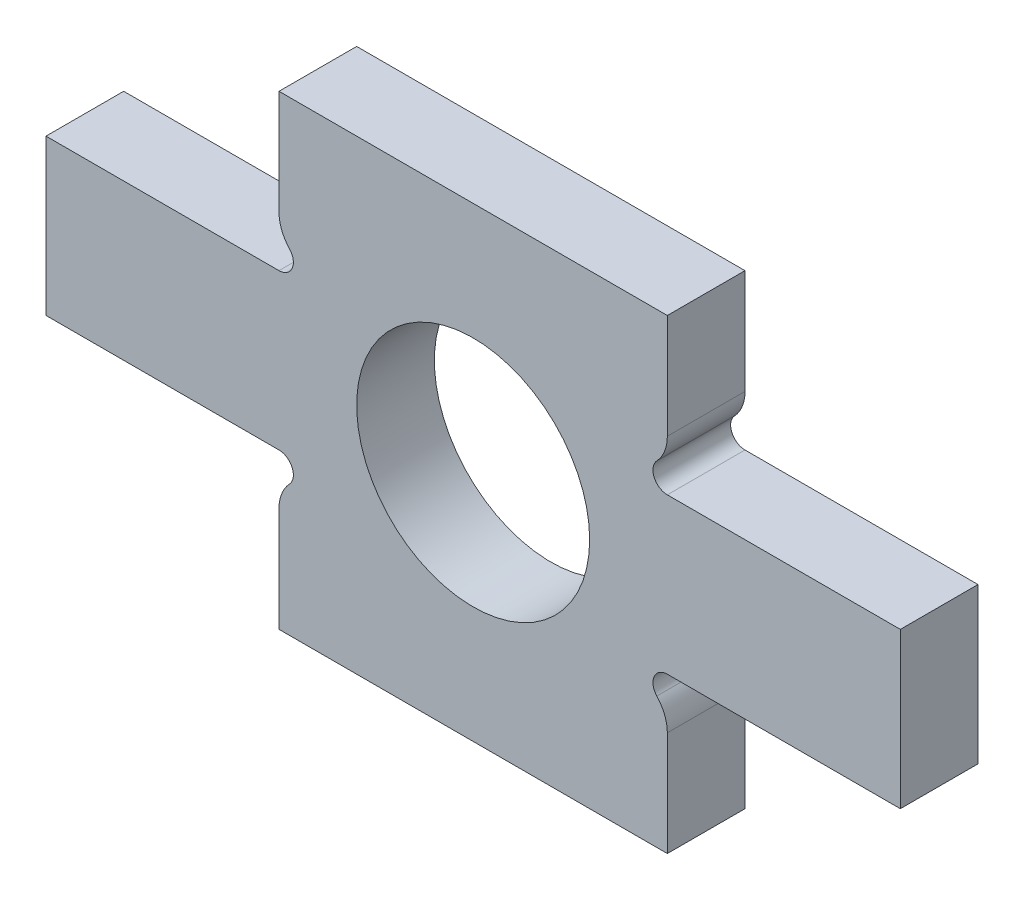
ISO-10303-21;
HEADER;
FILE_DESCRIPTION(('STEP AP214'),'2;1');
FILE_NAME('part.step','',(''),(''),'','','');
FILE_SCHEMA(('AUTOMOTIVE_DESIGN { 1 0 10303 214 1 1 1 1 }'));
ENDSEC;
DATA;
#1=APPLICATION_CONTEXT('core data for automotive mechanical design processes');
#2=APPLICATION_PROTOCOL_DEFINITION('international standard','automotive_design',2000,#1);
#3=PRODUCT_CONTEXT('',#1,'mechanical');
#4=PRODUCT('Part','Part','',(#3));
#5=PRODUCT_RELATED_PRODUCT_CATEGORY('part','',(#4));
#6=PRODUCT_DEFINITION_FORMATION('','',#4);
#7=PRODUCT_DEFINITION_CONTEXT('part definition',#1,'design');
#8=PRODUCT_DEFINITION('design','',#6,#7);
#9=PRODUCT_DEFINITION_SHAPE('','',#8);
#10=(LENGTH_UNIT() NAMED_UNIT(*) SI_UNIT(.MILLI.,.METRE.));
#11=(NAMED_UNIT(*) PLANE_ANGLE_UNIT() SI_UNIT($,.RADIAN.));
#12=(NAMED_UNIT(*) SI_UNIT($,.STERADIAN.) SOLID_ANGLE_UNIT());
#13=UNCERTAINTY_MEASURE_WITH_UNIT(LENGTH_MEASURE(1.E-05),#10,'distance_accuracy_value','');
#14=(GEOMETRIC_REPRESENTATION_CONTEXT(3) GLOBAL_UNCERTAINTY_ASSIGNED_CONTEXT((#13)) GLOBAL_UNIT_ASSIGNED_CONTEXT((#10,
#11,#12)) REPRESENTATION_CONTEXT('',''));
#15=CARTESIAN_POINT('',(0.,0.,0.));
#16=DIRECTION('',(0.,0.,1.));
#17=DIRECTION('',(1.,0.,0.));
#18=AXIS2_PLACEMENT_3D('',#15,#16,#17);
#19=CARTESIAN_POINT('',(19.9999999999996,-16.5321469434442,10.));
#20=DIRECTION('',(0.,0.,-1.));
#21=DIRECTION('',(-1.,0.,0.));
#22=AXIS2_PLACEMENT_3D('',#19,#20,#21);
#23=CYLINDRICAL_SURFACE('',#22,5.00000000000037);
#24=CARTESIAN_POINT('',(19.9999999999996,-16.5321469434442,0.));
#25=DIRECTION('',(0.,0.,1.));
#26=DIRECTION('',(1.,0.,0.));
#27=AXIS2_PLACEMENT_3D('',#24,#25,#26);
#28=CIRCLE('',#27,5.00000000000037);
#29=CARTESIAN_POINT('',(25.,-16.5321469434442,0.));
#30=VERTEX_POINT('',#29);
#31=CARTESIAN_POINT('',(23.6496350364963,-13.1145214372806,0.));
#32=VERTEX_POINT('',#31);
#33=EDGE_CURVE('E218',#30,#32,#28,.T.);
#34=ORIENTED_EDGE('',*,*,#33,.T.);
#35=DIRECTION('',(0.,0.,-1.));
#36=VECTOR('',#35,1.);
#37=CARTESIAN_POINT('',(23.6496350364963,-13.1145214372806,10.));
#38=LINE('',#37,#36);
#39=CARTESIAN_POINT('',(23.6496350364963,-13.1145214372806,10.));
#40=VERTEX_POINT('',#39);
#41=EDGE_CURVE('E11',#40,#32,#38,.T.);
#42=ORIENTED_EDGE('',*,*,#41,.F.);
#43=CARTESIAN_POINT('',(19.9999999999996,-16.5321469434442,10.));
#44=DIRECTION('',(0.,0.,1.));
#45=DIRECTION('',(1.,0.,0.));
#46=AXIS2_PLACEMENT_3D('',#43,#44,#45);
#47=CIRCLE('',#46,5.00000000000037);
#48=CARTESIAN_POINT('',(25.,-16.5321469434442,10.));
#49=VERTEX_POINT('',#48);
#50=EDGE_CURVE('E277',#49,#40,#47,.T.);
#51=ORIENTED_EDGE('',*,*,#50,.F.);
#52=DIRECTION('',(0.,0.,-1.));
#53=VECTOR('',#52,1.);
#54=CARTESIAN_POINT('',(25.,-16.5321469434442,10.));
#55=LINE('',#54,#53);
#56=EDGE_CURVE('E214',#49,#30,#55,.T.);
#57=ORIENTED_EDGE('',*,*,#56,.T.);
#58=EDGE_LOOP('',(#34,#42,#51,#57));
#59=FACE_BOUND('',#58,.T.);
#60=ADVANCED_FACE('F45',(#59),#23,.T.);
#61=CARTESIAN_POINT('',(25.,-11.8500000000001,10.));
#62=DIRECTION('',(0.,0.,-1.));
#63=DIRECTION('',(-1.,0.,0.));
#64=AXIS2_PLACEMENT_3D('',#61,#62,#63);
#65=CYLINDRICAL_SURFACE('',#64,1.85000000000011);
#66=CARTESIAN_POINT('',(25.,-11.8500000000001,0.));
#67=DIRECTION('',(0.,0.,-1.));
#68=DIRECTION('',(1.,0.,0.));
#69=AXIS2_PLACEMENT_3D('',#66,#67,#68);
#70=CIRCLE('',#69,1.85000000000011);
#71=CARTESIAN_POINT('',(25.,-10.,0.));
#72=VERTEX_POINT('',#71);
#73=EDGE_CURVE('E222',#32,#72,#70,.T.);
#74=ORIENTED_EDGE('',*,*,#73,.T.);
#75=DIRECTION('',(0.,0.,-1.));
#76=VECTOR('',#75,1.);
#77=CARTESIAN_POINT('',(25.,-10.,10.));
#78=LINE('',#77,#76);
#79=CARTESIAN_POINT('',(25.,-10.,10.));
#80=VERTEX_POINT('',#79);
#81=EDGE_CURVE('E54',#80,#72,#78,.T.);
#82=ORIENTED_EDGE('',*,*,#81,.F.);
#83=CARTESIAN_POINT('',(25.,-11.8500000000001,10.));
#84=DIRECTION('',(0.,0.,-1.));
#85=DIRECTION('',(1.,0.,0.));
#86=AXIS2_PLACEMENT_3D('',#83,#84,#85);
#87=CIRCLE('',#86,1.85000000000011);
#88=EDGE_CURVE('E141',#40,#80,#87,.T.);
#89=ORIENTED_EDGE('',*,*,#88,.F.);
#90=ORIENTED_EDGE('',*,*,#41,.T.);
#91=EDGE_LOOP('',(#74,#82,#89,#90));
#92=FACE_BOUND('',#91,.T.);
#93=ADVANCED_FACE('F428',(#92),#65,.F.);
#94=CARTESIAN_POINT('',(25.,-10.,10.));
#95=DIRECTION('',(0.,1.,0.));
#96=DIRECTION('',(0.,0.,1.));
#97=AXIS2_PLACEMENT_3D('',#94,#95,#96);
#98=PLANE('',#97);
#99=DIRECTION('',(1.,0.,0.));
#100=VECTOR('',#99,1.);
#101=CARTESIAN_POINT('',(25.,-10.,0.));
#102=LINE('',#101,#100);
#103=CARTESIAN_POINT('',(55.,-10.,0.));
#104=VERTEX_POINT('',#103);
#105=EDGE_CURVE('E226',#72,#104,#102,.T.);
#106=ORIENTED_EDGE('',*,*,#105,.T.);
#107=DIRECTION('',(0.,0.,-1.));
#108=VECTOR('',#107,1.);
#109=CARTESIAN_POINT('',(55.,-10.,10.));
#110=LINE('',#109,#108);
#111=CARTESIAN_POINT('',(55.,-10.,10.));
#112=VERTEX_POINT('',#111);
#113=EDGE_CURVE('E336',#112,#104,#110,.T.);
#114=ORIENTED_EDGE('',*,*,#113,.F.);
#115=DIRECTION('',(1.,0.,0.));
#116=VECTOR('',#115,1.);
#117=CARTESIAN_POINT('',(25.,-10.,10.));
#118=LINE('',#117,#116);
#119=EDGE_CURVE('E346',#80,#112,#118,.T.);
#120=ORIENTED_EDGE('',*,*,#119,.F.);
#121=ORIENTED_EDGE('',*,*,#81,.T.);
#122=EDGE_LOOP('',(#106,#114,#120,#121));
#123=FACE_BOUND('',#122,.T.);
#124=ADVANCED_FACE('F344',(#123),#98,.F.);
#125=CARTESIAN_POINT('',(55.,-10.,10.));
#126=DIRECTION('',(-1.,0.,0.));
#127=DIRECTION('',(0.,0.,1.));
#128=AXIS2_PLACEMENT_3D('',#125,#126,#127);
#129=PLANE('',#128);
#130=DIRECTION('',(0.,1.,0.));
#131=VECTOR('',#130,1.);
#132=CARTESIAN_POINT('',(55.,-10.,0.));
#133=LINE('',#132,#131);
#134=CARTESIAN_POINT('',(55.,10.,0.));
#135=VERTEX_POINT('',#134);
#136=EDGE_CURVE('E229',#104,#135,#133,.T.);
#137=ORIENTED_EDGE('',*,*,#136,.T.);
#138=DIRECTION('',(0.,0.,-1.));
#139=VECTOR('',#138,1.);
#140=CARTESIAN_POINT('',(55.,10.,10.));
#141=LINE('',#140,#139);
#142=CARTESIAN_POINT('',(55.,10.,10.));
#143=VERTEX_POINT('',#142);
#144=EDGE_CURVE('E332',#143,#135,#141,.T.);
#145=ORIENTED_EDGE('',*,*,#144,.F.);
#146=DIRECTION('',(0.,1.,0.));
#147=VECTOR('',#146,1.);
#148=CARTESIAN_POINT('',(55.,-10.,10.));
#149=LINE('',#148,#147);
#150=EDGE_CURVE('E365',#112,#143,#149,.T.);
#151=ORIENTED_EDGE('',*,*,#150,.F.);
#152=ORIENTED_EDGE('',*,*,#113,.T.);
#153=EDGE_LOOP('',(#137,#145,#151,#152));
#154=FACE_BOUND('',#153,.T.);
#155=ADVANCED_FACE('F355',(#154),#129,.F.);
#156=CARTESIAN_POINT('',(55.,10.,10.));
#157=DIRECTION('',(0.,-1.,0.));
#158=DIRECTION('',(0.,0.,-1.));
#159=AXIS2_PLACEMENT_3D('',#156,#157,#158);
#160=PLANE('',#159);
#161=DIRECTION('',(-1.,0.,0.));
#162=VECTOR('',#161,1.);
#163=CARTESIAN_POINT('',(55.,10.,0.));
#164=LINE('',#163,#162);
#165=CARTESIAN_POINT('',(25.,10.,0.));
#166=VERTEX_POINT('',#165);
#167=EDGE_CURVE('E232',#135,#166,#164,.T.);
#168=ORIENTED_EDGE('',*,*,#167,.T.);
#169=DIRECTION('',(0.,0.,-1.));
#170=VECTOR('',#169,1.);
#171=CARTESIAN_POINT('',(25.,10.,10.));
#172=LINE('',#171,#170);
#173=CARTESIAN_POINT('',(25.,10.,10.));
#174=VERTEX_POINT('',#173);
#175=EDGE_CURVE('E328',#174,#166,#172,.T.);
#176=ORIENTED_EDGE('',*,*,#175,.F.);
#177=DIRECTION('',(-1.,0.,0.));
#178=VECTOR('',#177,1.);
#179=CARTESIAN_POINT('',(55.,10.,10.));
#180=LINE('',#179,#178);
#181=EDGE_CURVE('E361',#143,#174,#180,.T.);
#182=ORIENTED_EDGE('',*,*,#181,.F.);
#183=ORIENTED_EDGE('',*,*,#144,.T.);
#184=EDGE_LOOP('',(#168,#176,#182,#183));
#185=FACE_BOUND('',#184,.T.);
#186=ADVANCED_FACE('F359',(#185),#160,.F.);
#187=CARTESIAN_POINT('',(25.,11.8500000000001,10.));
#188=DIRECTION('',(0.,0.,-1.));
#189=DIRECTION('',(-1.,0.,0.));
#190=AXIS2_PLACEMENT_3D('',#187,#188,#189);
#191=CYLINDRICAL_SURFACE('',#190,1.85000000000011);
#192=CARTESIAN_POINT('',(25.,11.8500000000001,0.));
#193=DIRECTION('',(0.,0.,-1.));
#194=DIRECTION('',(1.,0.,0.));
#195=AXIS2_PLACEMENT_3D('',#192,#193,#194);
#196=CIRCLE('',#195,1.85000000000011);
#197=CARTESIAN_POINT('',(23.6496350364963,13.1145214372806,0.));
#198=VERTEX_POINT('',#197);
#199=EDGE_CURVE('E235',#166,#198,#196,.T.);
#200=ORIENTED_EDGE('',*,*,#199,.T.);
#201=DIRECTION('',(0.,0.,-1.));
#202=VECTOR('',#201,1.);
#203=CARTESIAN_POINT('',(23.6496350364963,13.1145214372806,10.));
#204=LINE('',#203,#202);
#205=CARTESIAN_POINT('',(23.6496350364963,13.1145214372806,10.));
#206=VERTEX_POINT('',#205);
#207=EDGE_CURVE('E324',#206,#198,#204,.T.);
#208=ORIENTED_EDGE('',*,*,#207,.F.);
#209=CARTESIAN_POINT('',(25.,11.8500000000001,10.));
#210=DIRECTION('',(0.,0.,-1.));
#211=DIRECTION('',(1.,0.,0.));
#212=AXIS2_PLACEMENT_3D('',#209,#210,#211);
#213=CIRCLE('',#212,1.85000000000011);
#214=EDGE_CURVE('E364',#174,#206,#213,.T.);
#215=ORIENTED_EDGE('',*,*,#214,.F.);
#216=ORIENTED_EDGE('',*,*,#175,.T.);
#217=EDGE_LOOP('',(#200,#208,#215,#216));
#218=FACE_BOUND('',#217,.T.);
#219=ADVANCED_FACE('F441',(#218),#191,.F.);
#220=CARTESIAN_POINT('',(19.9999999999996,16.5321469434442,10.));
#221=DIRECTION('',(0.,0.,-1.));
#222=DIRECTION('',(-1.,0.,0.));
#223=AXIS2_PLACEMENT_3D('',#220,#221,#222);
#224=CYLINDRICAL_SURFACE('',#223,5.00000000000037);
#225=CARTESIAN_POINT('',(19.9999999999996,16.5321469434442,0.));
#226=DIRECTION('',(0.,0.,1.));
#227=DIRECTION('',(1.,0.,0.));
#228=AXIS2_PLACEMENT_3D('',#225,#226,#227);
#229=CIRCLE('',#228,5.00000000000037);
#230=CARTESIAN_POINT('',(25.,16.5321469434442,0.));
#231=VERTEX_POINT('',#230);
#232=EDGE_CURVE('E238',#198,#231,#229,.T.);
#233=ORIENTED_EDGE('',*,*,#232,.T.);
#234=DIRECTION('',(0.,0.,-1.));
#235=VECTOR('',#234,1.);
#236=CARTESIAN_POINT('',(25.,16.5321469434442,10.));
#237=LINE('',#236,#235);
#238=CARTESIAN_POINT('',(25.,16.5321469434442,10.));
#239=VERTEX_POINT('',#238);
#240=EDGE_CURVE('E320',#239,#231,#237,.T.);
#241=ORIENTED_EDGE('',*,*,#240,.F.);
#242=CARTESIAN_POINT('',(19.9999999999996,16.5321469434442,10.));
#243=DIRECTION('',(0.,0.,1.));
#244=DIRECTION('',(1.,0.,0.));
#245=AXIS2_PLACEMENT_3D('',#242,#243,#244);
#246=CIRCLE('',#245,5.00000000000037);
#247=EDGE_CURVE('E369',#206,#239,#246,.T.);
#248=ORIENTED_EDGE('',*,*,#247,.F.);
#249=ORIENTED_EDGE('',*,*,#207,.T.);
#250=EDGE_LOOP('',(#233,#241,#248,#249));
#251=FACE_BOUND('',#250,.T.);
#252=ADVANCED_FACE('F444',(#251),#224,.T.);
#253=CARTESIAN_POINT('',(25.,16.5321469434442,10.));
#254=DIRECTION('',(-1.,0.,0.));
#255=DIRECTION('',(0.,-1.,0.));
#256=AXIS2_PLACEMENT_3D('',#253,#254,#255);
#257=PLANE('',#256);
#258=DIRECTION('',(0.,1.,0.));
#259=VECTOR('',#258,1.);
#260=CARTESIAN_POINT('',(25.,16.5321469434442,0.));
#261=LINE('',#260,#259);
#262=CARTESIAN_POINT('',(25.,30.,0.));
#263=VERTEX_POINT('',#262);
#264=EDGE_CURVE('E241',#231,#263,#261,.T.);
#265=ORIENTED_EDGE('',*,*,#264,.T.);
#266=DIRECTION('',(0.,0.,-1.));
#267=VECTOR('',#266,1.);
#268=CARTESIAN_POINT('',(25.,30.,10.));
#269=LINE('',#268,#267);
#270=CARTESIAN_POINT('',(25.,30.,10.));
#271=VERTEX_POINT('',#270);
#272=EDGE_CURVE('E316',#271,#263,#269,.T.);
#273=ORIENTED_EDGE('',*,*,#272,.F.);
#274=DIRECTION('',(0.,1.,0.));
#275=VECTOR('',#274,1.);
#276=CARTESIAN_POINT('',(25.,16.5321469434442,10.));
#277=LINE('',#276,#275);
#278=EDGE_CURVE('E376',#239,#271,#277,.T.);
#279=ORIENTED_EDGE('',*,*,#278,.F.);
#280=ORIENTED_EDGE('',*,*,#240,.T.);
#281=EDGE_LOOP('',(#265,#273,#279,#280));
#282=FACE_BOUND('',#281,.T.);
#283=ADVANCED_FACE('F448',(#282),#257,.F.);
#284=CARTESIAN_POINT('',(25.,30.,10.));
#285=DIRECTION('',(0.,-1.,0.));
#286=DIRECTION('',(0.,0.,-1.));
#287=AXIS2_PLACEMENT_3D('',#284,#285,#286);
#288=PLANE('',#287);
#289=DIRECTION('',(-1.,0.,0.));
#290=VECTOR('',#289,1.);
#291=CARTESIAN_POINT('',(25.,30.,0.));
#292=LINE('',#291,#290);
#293=CARTESIAN_POINT('',(-25.,30.,0.));
#294=VERTEX_POINT('',#293);
#295=EDGE_CURVE('E244',#263,#294,#292,.T.);
#296=ORIENTED_EDGE('',*,*,#295,.T.);
#297=DIRECTION('',(0.,0.,-1.));
#298=VECTOR('',#297,1.);
#299=CARTESIAN_POINT('',(-25.,30.,10.));
#300=LINE('',#299,#298);
#301=CARTESIAN_POINT('',(-25.,30.,10.));
#302=VERTEX_POINT('',#301);
#303=EDGE_CURVE('E312',#302,#294,#300,.T.);
#304=ORIENTED_EDGE('',*,*,#303,.F.);
#305=DIRECTION('',(-1.,0.,0.));
#306=VECTOR('',#305,1.);
#307=CARTESIAN_POINT('',(25.,30.,10.));
#308=LINE('',#307,#306);
#309=EDGE_CURVE('E379',#271,#302,#308,.T.);
#310=ORIENTED_EDGE('',*,*,#309,.F.);
#311=ORIENTED_EDGE('',*,*,#272,.T.);
#312=EDGE_LOOP('',(#296,#304,#310,#311));
#313=FACE_BOUND('',#312,.T.);
#314=ADVANCED_FACE('F452',(#313),#288,.F.);
#315=CARTESIAN_POINT('',(-25.,30.,10.));
#316=DIRECTION('',(1.,0.,0.));
#317=DIRECTION('',(0.,0.,-1.));
#318=AXIS2_PLACEMENT_3D('',#315,#316,#317);
#319=PLANE('',#318);
#320=DIRECTION('',(0.,-1.,0.));
#321=VECTOR('',#320,1.);
#322=CARTESIAN_POINT('',(-25.,30.,0.));
#323=LINE('',#322,#321);
#324=CARTESIAN_POINT('',(-25.,16.5321469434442,0.));
#325=VERTEX_POINT('',#324);
#326=EDGE_CURVE('E247',#294,#325,#323,.T.);
#327=ORIENTED_EDGE('',*,*,#326,.T.);
#328=DIRECTION('',(0.,0.,-1.));
#329=VECTOR('',#328,1.);
#330=CARTESIAN_POINT('',(-25.,16.5321469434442,10.));
#331=LINE('',#330,#329);
#332=CARTESIAN_POINT('',(-25.,16.5321469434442,10.));
#333=VERTEX_POINT('',#332);
#334=EDGE_CURVE('E308',#333,#325,#331,.T.);
#335=ORIENTED_EDGE('',*,*,#334,.F.);
#336=DIRECTION('',(0.,-1.,0.));
#337=VECTOR('',#336,1.);
#338=CARTESIAN_POINT('',(-25.,30.,10.));
#339=LINE('',#338,#337);
#340=EDGE_CURVE('E382',#302,#333,#339,.T.);
#341=ORIENTED_EDGE('',*,*,#340,.F.);
#342=ORIENTED_EDGE('',*,*,#303,.T.);
#343=EDGE_LOOP('',(#327,#335,#341,#342));
#344=FACE_BOUND('',#343,.T.);
#345=ADVANCED_FACE('F456',(#344),#319,.F.);
#346=CARTESIAN_POINT('',(-19.9999999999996,16.5321469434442,10.));
#347=DIRECTION('',(0.,0.,-1.));
#348=DIRECTION('',(-1.,0.,0.));
#349=AXIS2_PLACEMENT_3D('',#346,#347,#348);
#350=CYLINDRICAL_SURFACE('',#349,5.00000000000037);
#351=CARTESIAN_POINT('',(-19.9999999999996,16.5321469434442,0.));
#352=DIRECTION('',(0.,0.,1.));
#353=DIRECTION('',(1.,0.,0.));
#354=AXIS2_PLACEMENT_3D('',#351,#352,#353);
#355=CIRCLE('',#354,5.00000000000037);
#356=CARTESIAN_POINT('',(-23.6496350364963,13.1145214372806,0.));
#357=VERTEX_POINT('',#356);
#358=EDGE_CURVE('E250',#325,#357,#355,.T.);
#359=ORIENTED_EDGE('',*,*,#358,.T.);
#360=DIRECTION('',(0.,0.,-1.));
#361=VECTOR('',#360,1.);
#362=CARTESIAN_POINT('',(-23.6496350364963,13.1145214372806,10.));
#363=LINE('',#362,#361);
#364=CARTESIAN_POINT('',(-23.6496350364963,13.1145214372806,10.));
#365=VERTEX_POINT('',#364);
#366=EDGE_CURVE('E304',#365,#357,#363,.T.);
#367=ORIENTED_EDGE('',*,*,#366,.F.);
#368=CARTESIAN_POINT('',(-19.9999999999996,16.5321469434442,10.));
#369=DIRECTION('',(0.,0.,1.));
#370=DIRECTION('',(1.,0.,0.));
#371=AXIS2_PLACEMENT_3D('',#368,#369,#370);
#372=CIRCLE('',#371,5.00000000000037);
#373=EDGE_CURVE('E385',#333,#365,#372,.T.);
#374=ORIENTED_EDGE('',*,*,#373,.F.);
#375=ORIENTED_EDGE('',*,*,#334,.T.);
#376=EDGE_LOOP('',(#359,#367,#374,#375));
#377=FACE_BOUND('',#376,.T.);
#378=ADVANCED_FACE('F460',(#377),#350,.T.);
#379=CARTESIAN_POINT('',(-25.,11.8500000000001,10.));
#380=DIRECTION('',(0.,0.,-1.));
#381=DIRECTION('',(-1.,0.,0.));
#382=AXIS2_PLACEMENT_3D('',#379,#380,#381);
#383=CYLINDRICAL_SURFACE('',#382,1.85000000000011);
#384=CARTESIAN_POINT('',(-25.,11.8500000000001,0.));
#385=DIRECTION('',(0.,0.,-1.));
#386=DIRECTION('',(1.,0.,0.));
#387=AXIS2_PLACEMENT_3D('',#384,#385,#386);
#388=CIRCLE('',#387,1.85000000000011);
#389=CARTESIAN_POINT('',(-25.,10.,0.));
#390=VERTEX_POINT('',#389);
#391=EDGE_CURVE('E253',#357,#390,#388,.T.);
#392=ORIENTED_EDGE('',*,*,#391,.T.);
#393=DIRECTION('',(0.,0.,-1.));
#394=VECTOR('',#393,1.);
#395=CARTESIAN_POINT('',(-25.,10.,10.));
#396=LINE('',#395,#394);
#397=CARTESIAN_POINT('',(-25.,10.,10.));
#398=VERTEX_POINT('',#397);
#399=EDGE_CURVE('E300',#398,#390,#396,.T.);
#400=ORIENTED_EDGE('',*,*,#399,.F.);
#401=CARTESIAN_POINT('',(-25.,11.8500000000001,10.));
#402=DIRECTION('',(0.,0.,-1.));
#403=DIRECTION('',(1.,0.,0.));
#404=AXIS2_PLACEMENT_3D('',#401,#402,#403);
#405=CIRCLE('',#404,1.85000000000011);
#406=EDGE_CURVE('E388',#365,#398,#405,.T.);
#407=ORIENTED_EDGE('',*,*,#406,.F.);
#408=ORIENTED_EDGE('',*,*,#366,.T.);
#409=EDGE_LOOP('',(#392,#400,#407,#408));
#410=FACE_BOUND('',#409,.T.);
#411=ADVANCED_FACE('F464',(#410),#383,.F.);
#412=CARTESIAN_POINT('',(-25.,10.,10.));
#413=DIRECTION('',(0.,-1.,0.));
#414=DIRECTION('',(0.,0.,-1.));
#415=AXIS2_PLACEMENT_3D('',#412,#413,#414);
#416=PLANE('',#415);
#417=DIRECTION('',(-1.,0.,0.));
#418=VECTOR('',#417,1.);
#419=CARTESIAN_POINT('',(-25.,10.,0.));
#420=LINE('',#419,#418);
#421=CARTESIAN_POINT('',(-55.,10.,0.));
#422=VERTEX_POINT('',#421);
#423=EDGE_CURVE('E256',#390,#422,#420,.T.);
#424=ORIENTED_EDGE('',*,*,#423,.T.);
#425=DIRECTION('',(0.,0.,-1.));
#426=VECTOR('',#425,1.);
#427=CARTESIAN_POINT('',(-55.,10.,10.));
#428=LINE('',#427,#426);
#429=CARTESIAN_POINT('',(-55.,10.,10.));
#430=VERTEX_POINT('',#429);
#431=EDGE_CURVE('E296',#430,#422,#428,.T.);
#432=ORIENTED_EDGE('',*,*,#431,.F.);
#433=DIRECTION('',(-1.,0.,0.));
#434=VECTOR('',#433,1.);
#435=CARTESIAN_POINT('',(-25.,10.,10.));
#436=LINE('',#435,#434);
#437=EDGE_CURVE('E391',#398,#430,#436,.T.);
#438=ORIENTED_EDGE('',*,*,#437,.F.);
#439=ORIENTED_EDGE('',*,*,#399,.T.);
#440=EDGE_LOOP('',(#424,#432,#438,#439));
#441=FACE_BOUND('',#440,.T.);
#442=ADVANCED_FACE('F468',(#441),#416,.F.);
#443=CARTESIAN_POINT('',(-55.,10.,10.));
#444=DIRECTION('',(1.,0.,0.));
#445=DIRECTION('',(0.,0.,-1.));
#446=AXIS2_PLACEMENT_3D('',#443,#444,#445);
#447=PLANE('',#446);
#448=DIRECTION('',(0.,-1.,0.));
#449=VECTOR('',#448,1.);
#450=CARTESIAN_POINT('',(-55.,10.,0.));
#451=LINE('',#450,#449);
#452=CARTESIAN_POINT('',(-55.,-10.,0.));
#453=VERTEX_POINT('',#452);
#454=EDGE_CURVE('E259',#422,#453,#451,.T.);
#455=ORIENTED_EDGE('',*,*,#454,.T.);
#456=DIRECTION('',(0.,0.,-1.));
#457=VECTOR('',#456,1.);
#458=CARTESIAN_POINT('',(-55.,-10.,10.));
#459=LINE('',#458,#457);
#460=CARTESIAN_POINT('',(-55.,-10.,10.));
#461=VERTEX_POINT('',#460);
#462=EDGE_CURVE('E292',#461,#453,#459,.T.);
#463=ORIENTED_EDGE('',*,*,#462,.F.);
#464=DIRECTION('',(0.,-1.,0.));
#465=VECTOR('',#464,1.);
#466=CARTESIAN_POINT('',(-55.,10.,10.));
#467=LINE('',#466,#465);
#468=EDGE_CURVE('E394',#430,#461,#467,.T.);
#469=ORIENTED_EDGE('',*,*,#468,.F.);
#470=ORIENTED_EDGE('',*,*,#431,.T.);
#471=EDGE_LOOP('',(#455,#463,#469,#470));
#472=FACE_BOUND('',#471,.T.);
#473=ADVANCED_FACE('F472',(#472),#447,.F.);
#474=CARTESIAN_POINT('',(-55.,-10.,10.));
#475=DIRECTION('',(0.,1.,0.));
#476=DIRECTION('',(0.,0.,1.));
#477=AXIS2_PLACEMENT_3D('',#474,#475,#476);
#478=PLANE('',#477);
#479=DIRECTION('',(1.,0.,0.));
#480=VECTOR('',#479,1.);
#481=CARTESIAN_POINT('',(-55.,-10.,0.));
#482=LINE('',#481,#480);
#483=CARTESIAN_POINT('',(-25.,-10.,0.));
#484=VERTEX_POINT('',#483);
#485=EDGE_CURVE('E262',#453,#484,#482,.T.);
#486=ORIENTED_EDGE('',*,*,#485,.T.);
#487=DIRECTION('',(0.,0.,-1.));
#488=VECTOR('',#487,1.);
#489=CARTESIAN_POINT('',(-25.,-10.,10.));
#490=LINE('',#489,#488);
#491=CARTESIAN_POINT('',(-25.,-10.,10.));
#492=VERTEX_POINT('',#491);
#493=EDGE_CURVE('E288',#492,#484,#490,.T.);
#494=ORIENTED_EDGE('',*,*,#493,.F.);
#495=DIRECTION('',(1.,0.,0.));
#496=VECTOR('',#495,1.);
#497=CARTESIAN_POINT('',(-55.,-10.,10.));
#498=LINE('',#497,#496);
#499=EDGE_CURVE('E397',#461,#492,#498,.T.);
#500=ORIENTED_EDGE('',*,*,#499,.F.);
#501=ORIENTED_EDGE('',*,*,#462,.T.);
#502=EDGE_LOOP('',(#486,#494,#500,#501));
#503=FACE_BOUND('',#502,.T.);
#504=ADVANCED_FACE('F476',(#503),#478,.F.);
#505=CARTESIAN_POINT('',(-25.,-11.8500000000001,10.));
#506=DIRECTION('',(0.,0.,-1.));
#507=DIRECTION('',(-1.,0.,0.));
#508=AXIS2_PLACEMENT_3D('',#505,#506,#507);
#509=CYLINDRICAL_SURFACE('',#508,1.85000000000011);
#510=CARTESIAN_POINT('',(-25.,-11.8500000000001,0.));
#511=DIRECTION('',(0.,0.,-1.));
#512=DIRECTION('',(1.,0.,0.));
#513=AXIS2_PLACEMENT_3D('',#510,#511,#512);
#514=CIRCLE('',#513,1.85000000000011);
#515=CARTESIAN_POINT('',(-23.6496350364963,-13.1145214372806,0.));
#516=VERTEX_POINT('',#515);
#517=EDGE_CURVE('E265',#484,#516,#514,.T.);
#518=ORIENTED_EDGE('',*,*,#517,.T.);
#519=DIRECTION('',(0.,0.,-1.));
#520=VECTOR('',#519,1.);
#521=CARTESIAN_POINT('',(-23.6496350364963,-13.1145214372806,10.));
#522=LINE('',#521,#520);
#523=CARTESIAN_POINT('',(-23.6496350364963,-13.1145214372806,10.));
#524=VERTEX_POINT('',#523);
#525=EDGE_CURVE('E284',#524,#516,#522,.T.);
#526=ORIENTED_EDGE('',*,*,#525,.F.);
#527=CARTESIAN_POINT('',(-25.,-11.8500000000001,10.));
#528=DIRECTION('',(0.,0.,-1.));
#529=DIRECTION('',(1.,0.,0.));
#530=AXIS2_PLACEMENT_3D('',#527,#528,#529);
#531=CIRCLE('',#530,1.85000000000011);
#532=EDGE_CURVE('E400',#492,#524,#531,.T.);
#533=ORIENTED_EDGE('',*,*,#532,.F.);
#534=ORIENTED_EDGE('',*,*,#493,.T.);
#535=EDGE_LOOP('',(#518,#526,#533,#534));
#536=FACE_BOUND('',#535,.T.);
#537=ADVANCED_FACE('F408',(#536),#509,.F.);
#538=CARTESIAN_POINT('',(-19.9999999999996,-16.5321469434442,10.));
#539=DIRECTION('',(0.,0.,-1.));
#540=DIRECTION('',(-1.,0.,0.));
#541=AXIS2_PLACEMENT_3D('',#538,#539,#540);
#542=CYLINDRICAL_SURFACE('',#541,5.00000000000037);
#543=CARTESIAN_POINT('',(-19.9999999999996,-16.5321469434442,0.));
#544=DIRECTION('',(0.,0.,1.));
#545=DIRECTION('',(1.,0.,0.));
#546=AXIS2_PLACEMENT_3D('',#543,#544,#545);
#547=CIRCLE('',#546,5.00000000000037);
#548=CARTESIAN_POINT('',(-25.,-16.5321469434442,0.));
#549=VERTEX_POINT('',#548);
#550=EDGE_CURVE('E268',#516,#549,#547,.T.);
#551=ORIENTED_EDGE('',*,*,#550,.T.);
#552=DIRECTION('',(0.,0.,-1.));
#553=VECTOR('',#552,1.);
#554=CARTESIAN_POINT('',(-25.,-16.5321469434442,10.));
#555=LINE('',#554,#553);
#556=CARTESIAN_POINT('',(-25.,-16.5321469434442,10.));
#557=VERTEX_POINT('',#556);
#558=EDGE_CURVE('E207',#557,#549,#555,.T.);
#559=ORIENTED_EDGE('',*,*,#558,.F.);
#560=CARTESIAN_POINT('',(-19.9999999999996,-16.5321469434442,10.));
#561=DIRECTION('',(0.,0.,1.));
#562=DIRECTION('',(1.,0.,0.));
#563=AXIS2_PLACEMENT_3D('',#560,#561,#562);
#564=CIRCLE('',#563,5.00000000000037);
#565=EDGE_CURVE('E196',#524,#557,#564,.T.);
#566=ORIENTED_EDGE('',*,*,#565,.F.);
#567=ORIENTED_EDGE('',*,*,#525,.T.);
#568=EDGE_LOOP('',(#551,#559,#566,#567));
#569=FACE_BOUND('',#568,.T.);
#570=ADVANCED_FACE('F412',(#569),#542,.T.);
#571=CARTESIAN_POINT('',(-25.,-16.5321469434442,10.));
#572=DIRECTION('',(1.,0.,0.));
#573=DIRECTION('',(0.,0.,-1.));
#574=AXIS2_PLACEMENT_3D('',#571,#572,#573);
#575=PLANE('',#574);
#576=DIRECTION('',(0.,-1.,0.));
#577=VECTOR('',#576,1.);
#578=CARTESIAN_POINT('',(-25.,-16.5321469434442,0.));
#579=LINE('',#578,#577);
#580=CARTESIAN_POINT('',(-25.,-30.,0.));
#581=VERTEX_POINT('',#580);
#582=EDGE_CURVE('E205',#549,#581,#579,.T.);
#583=ORIENTED_EDGE('',*,*,#582,.T.);
#584=DIRECTION('',(0.,0.,-1.));
#585=VECTOR('',#584,1.);
#586=CARTESIAN_POINT('',(-25.,-30.,10.));
#587=LINE('',#586,#585);
#588=CARTESIAN_POINT('',(-25.,-30.,10.));
#589=VERTEX_POINT('',#588);
#590=EDGE_CURVE('E202',#589,#581,#587,.T.);
#591=ORIENTED_EDGE('',*,*,#590,.F.);
#592=DIRECTION('',(0.,-1.,0.));
#593=VECTOR('',#592,1.);
#594=CARTESIAN_POINT('',(-25.,-16.5321469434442,10.));
#595=LINE('',#594,#593);
#596=EDGE_CURVE('E190',#557,#589,#595,.T.);
#597=ORIENTED_EDGE('',*,*,#596,.F.);
#598=ORIENTED_EDGE('',*,*,#558,.T.);
#599=EDGE_LOOP('',(#583,#591,#597,#598));
#600=FACE_BOUND('',#599,.T.);
#601=ADVANCED_FACE('F203',(#600),#575,.F.);
#602=CARTESIAN_POINT('',(-25.,-30.,10.));
#603=DIRECTION('',(0.,1.,0.));
#604=DIRECTION('',(0.,0.,1.));
#605=AXIS2_PLACEMENT_3D('',#602,#603,#604);
#606=PLANE('',#605);
#607=DIRECTION('',(1.,0.,0.));
#608=VECTOR('',#607,1.);
#609=CARTESIAN_POINT('',(-25.,-30.,0.));
#610=LINE('',#609,#608);
#611=CARTESIAN_POINT('',(25.,-30.,0.));
#612=VERTEX_POINT('',#611);
#613=EDGE_CURVE('E127',#581,#612,#610,.T.);
#614=ORIENTED_EDGE('',*,*,#613,.T.);
#615=DIRECTION('',(0.,0.,-1.));
#616=VECTOR('',#615,1.);
#617=CARTESIAN_POINT('',(25.,-30.,10.));
#618=LINE('',#617,#616);
#619=CARTESIAN_POINT('',(25.,-30.,10.));
#620=VERTEX_POINT('',#619);
#621=EDGE_CURVE('E208',#620,#612,#618,.T.);
#622=ORIENTED_EDGE('',*,*,#621,.F.);
#623=DIRECTION('',(1.,0.,0.));
#624=VECTOR('',#623,1.);
#625=CARTESIAN_POINT('',(-25.,-30.,10.));
#626=LINE('',#625,#624);
#627=EDGE_CURVE('E194',#589,#620,#626,.T.);
#628=ORIENTED_EDGE('',*,*,#627,.F.);
#629=ORIENTED_EDGE('',*,*,#590,.T.);
#630=EDGE_LOOP('',(#614,#622,#628,#629));
#631=FACE_BOUND('',#630,.T.);
#632=ADVANCED_FACE('F210',(#631),#606,.F.);
#633=CARTESIAN_POINT('',(25.,-30.,10.));
#634=DIRECTION('',(-1.,0.,0.));
#635=DIRECTION('',(0.,0.,1.));
#636=AXIS2_PLACEMENT_3D('',#633,#634,#635);
#637=PLANE('',#636);
#638=DIRECTION('',(0.,1.,0.));
#639=VECTOR('',#638,1.);
#640=CARTESIAN_POINT('',(25.,-30.,0.));
#641=LINE('',#640,#639);
#642=EDGE_CURVE('E133',#612,#30,#641,.T.);
#643=ORIENTED_EDGE('',*,*,#642,.T.);
#644=ORIENTED_EDGE('',*,*,#56,.F.);
#645=DIRECTION('',(0.,1.,0.));
#646=VECTOR('',#645,1.);
#647=CARTESIAN_POINT('',(25.,-30.,10.));
#648=LINE('',#647,#646);
#649=EDGE_CURVE('E62',#620,#49,#648,.T.);
#650=ORIENTED_EDGE('',*,*,#649,.F.);
#651=ORIENTED_EDGE('',*,*,#621,.T.);
#652=EDGE_LOOP('',(#643,#644,#650,#651));
#653=FACE_BOUND('',#652,.T.);
#654=ADVANCED_FACE('F416',(#653),#637,.F.);
#655=CARTESIAN_POINT('',(19.9999999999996,-16.5321469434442,10.));
#656=DIRECTION('',(0.,0.,1.));
#657=DIRECTION('',(1.,0.,0.));
#658=AXIS2_PLACEMENT_3D('',#655,#656,#657);
#659=PLANE('',#658);
#660=CARTESIAN_POINT('',(0.,0.,10.));
#661=DIRECTION('',(0.,0.,1.));
#662=DIRECTION('',(1.,0.,0.));
#663=AXIS2_PLACEMENT_3D('',#660,#661,#662);
#664=CIRCLE('',#663,15.);
#665=CARTESIAN_POINT('',(15.,0.,10.));
#666=VERTEX_POINT('',#665);
#667=EDGE_CURVE('E532',#666,#666,#664,.T.);
#668=ORIENTED_EDGE('',*,*,#667,.F.);
#669=EDGE_LOOP('',(#668));
#670=FACE_BOUND('',#669,.T.);
#671=ORIENTED_EDGE('',*,*,#50,.T.);
#672=ORIENTED_EDGE('',*,*,#88,.T.);
#673=ORIENTED_EDGE('',*,*,#119,.T.);
#674=ORIENTED_EDGE('',*,*,#150,.T.);
#675=ORIENTED_EDGE('',*,*,#181,.T.);
#676=ORIENTED_EDGE('',*,*,#214,.T.);
#677=ORIENTED_EDGE('',*,*,#247,.T.);
#678=ORIENTED_EDGE('',*,*,#278,.T.);
#679=ORIENTED_EDGE('',*,*,#309,.T.);
#680=ORIENTED_EDGE('',*,*,#340,.T.);
#681=ORIENTED_EDGE('',*,*,#373,.T.);
#682=ORIENTED_EDGE('',*,*,#406,.T.);
#683=ORIENTED_EDGE('',*,*,#437,.T.);
#684=ORIENTED_EDGE('',*,*,#468,.T.);
#685=ORIENTED_EDGE('',*,*,#499,.T.);
#686=ORIENTED_EDGE('',*,*,#532,.T.);
#687=ORIENTED_EDGE('',*,*,#565,.T.);
#688=ORIENTED_EDGE('',*,*,#596,.T.);
#689=ORIENTED_EDGE('',*,*,#627,.T.);
#690=ORIENTED_EDGE('',*,*,#649,.T.);
#691=EDGE_LOOP('',(#671,#672,#673,#674,#675,#676,#677,#678,#679,#680,#681,#682,#683,#684,#685,
#686,#687,#688,#689,#690));
#692=FACE_BOUND('',#691,.T.);
#693=ADVANCED_FACE('F192',(#670,#692),#659,.T.);
#694=CARTESIAN_POINT('',(19.9999999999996,-16.5321469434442,0.));
#695=DIRECTION('',(0.,0.,1.));
#696=DIRECTION('',(1.,0.,0.));
#697=AXIS2_PLACEMENT_3D('',#694,#695,#696);
#698=PLANE('',#697);
#699=CARTESIAN_POINT('',(0.,0.,0.));
#700=DIRECTION('',(0.,0.,1.));
#701=DIRECTION('',(1.,0.,0.));
#702=AXIS2_PLACEMENT_3D('',#699,#700,#701);
#703=CIRCLE('',#702,15.);
#704=CARTESIAN_POINT('',(15.,0.,0.));
#705=VERTEX_POINT('',#704);
#706=EDGE_CURVE('E223',#705,#705,#703,.T.);
#707=ORIENTED_EDGE('',*,*,#706,.T.);
#708=EDGE_LOOP('',(#707));
#709=FACE_BOUND('',#708,.T.);
#710=ORIENTED_EDGE('',*,*,#33,.F.);
#711=ORIENTED_EDGE('',*,*,#642,.F.);
#712=ORIENTED_EDGE('',*,*,#613,.F.);
#713=ORIENTED_EDGE('',*,*,#582,.F.);
#714=ORIENTED_EDGE('',*,*,#550,.F.);
#715=ORIENTED_EDGE('',*,*,#517,.F.);
#716=ORIENTED_EDGE('',*,*,#485,.F.);
#717=ORIENTED_EDGE('',*,*,#454,.F.);
#718=ORIENTED_EDGE('',*,*,#423,.F.);
#719=ORIENTED_EDGE('',*,*,#391,.F.);
#720=ORIENTED_EDGE('',*,*,#358,.F.);
#721=ORIENTED_EDGE('',*,*,#326,.F.);
#722=ORIENTED_EDGE('',*,*,#295,.F.);
#723=ORIENTED_EDGE('',*,*,#264,.F.);
#724=ORIENTED_EDGE('',*,*,#232,.F.);
#725=ORIENTED_EDGE('',*,*,#199,.F.);
#726=ORIENTED_EDGE('',*,*,#167,.F.);
#727=ORIENTED_EDGE('',*,*,#136,.F.);
#728=ORIENTED_EDGE('',*,*,#105,.F.);
#729=ORIENTED_EDGE('',*,*,#73,.F.);
#730=EDGE_LOOP('',(#710,#711,#712,#713,#714,#715,#716,#717,#718,#719,#720,#721,#722,#723,#724,
#725,#726,#727,#728,#729));
#731=FACE_BOUND('',#730,.T.);
#732=ADVANCED_FACE('F350',(#709,#731),#698,.F.);
#733=CARTESIAN_POINT('',(0.,0.,0.));
#734=DIRECTION('',(0.,0.,1.));
#735=DIRECTION('',(1.,0.,0.));
#736=AXIS2_PLACEMENT_3D('',#733,#734,#735);
#737=CYLINDRICAL_SURFACE('',#736,15.);
#738=ORIENTED_EDGE('',*,*,#706,.F.);
#739=EDGE_LOOP('',(#738));
#740=FACE_BOUND('',#739,.T.);
#741=ORIENTED_EDGE('',*,*,#667,.T.);
#742=EDGE_LOOP('',(#741));
#743=FACE_BOUND('',#742,.T.);
#744=ADVANCED_FACE('F515',(#740,#743),#737,.F.);
#745=CLOSED_SHELL('',(#60,#93,#124,#155,#186,#219,#252,#283,#314,#345,#378,#411,#442,#473,#504,
#537,#570,#601,#632,#654,#693,#732,#744));
#746=MANIFOLD_SOLID_BREP('B2',#745);
#747=ADVANCED_BREP_SHAPE_REPRESENTATION('',(#18,#746),#14);
#748=SHAPE_DEFINITION_REPRESENTATION(#9,#747);
ENDSEC;
END-ISO-10303-21;
